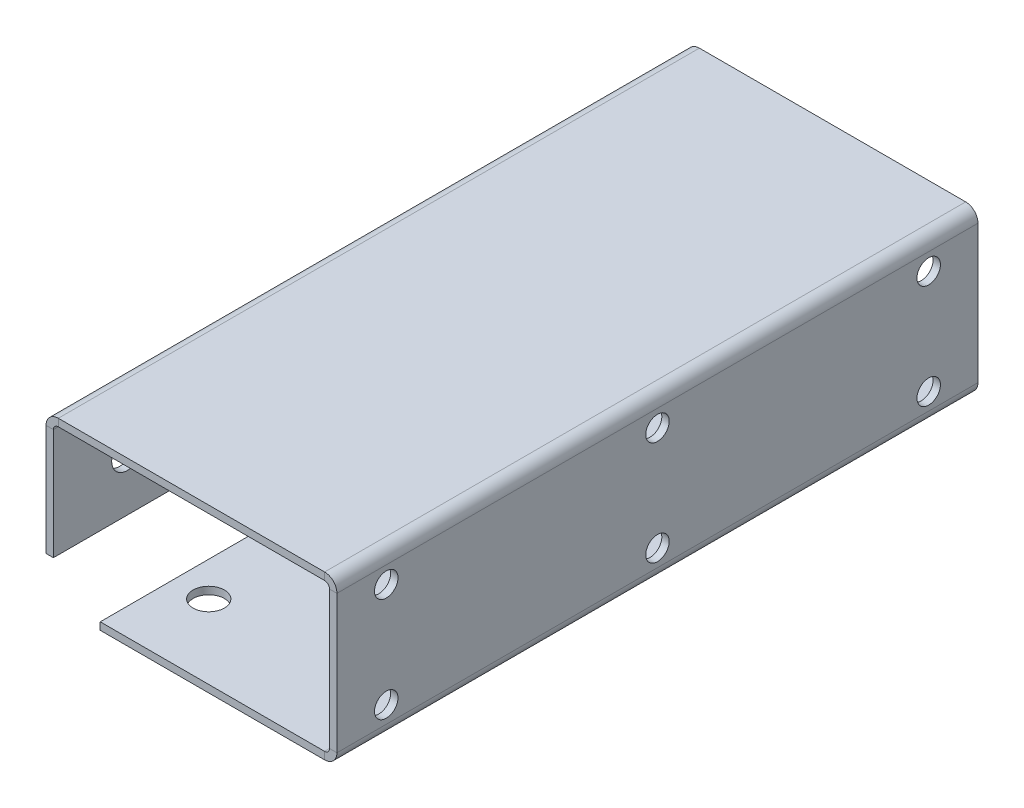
ISO-10303-21;
HEADER;
FILE_DESCRIPTION(('STEP AP214'),'2;1');
FILE_NAME('part.step','',(''),(''),'','','');
FILE_SCHEMA(('AUTOMOTIVE_DESIGN { 1 0 10303 214 1 1 1 1 }'));
ENDSEC;
DATA;
#1=APPLICATION_CONTEXT('core data for automotive mechanical design processes');
#2=APPLICATION_PROTOCOL_DEFINITION('international standard','automotive_design',2000,#1);
#3=PRODUCT_CONTEXT('',#1,'mechanical');
#4=PRODUCT('Part','Part','',(#3));
#5=PRODUCT_RELATED_PRODUCT_CATEGORY('part','',(#4));
#6=PRODUCT_DEFINITION_FORMATION('','',#4);
#7=PRODUCT_DEFINITION_CONTEXT('part definition',#1,'design');
#8=PRODUCT_DEFINITION('design','',#6,#7);
#9=PRODUCT_DEFINITION_SHAPE('','',#8);
#10=(LENGTH_UNIT() NAMED_UNIT(*) SI_UNIT(.MILLI.,.METRE.));
#11=(NAMED_UNIT(*) PLANE_ANGLE_UNIT() SI_UNIT($,.RADIAN.));
#12=(NAMED_UNIT(*) SI_UNIT($,.STERADIAN.) SOLID_ANGLE_UNIT());
#13=UNCERTAINTY_MEASURE_WITH_UNIT(LENGTH_MEASURE(1.E-05),#10,'distance_accuracy_value','');
#14=(GEOMETRIC_REPRESENTATION_CONTEXT(3) GLOBAL_UNCERTAINTY_ASSIGNED_CONTEXT((#13)) GLOBAL_UNIT_ASSIGNED_CONTEXT((#10,
#11,#12)) REPRESENTATION_CONTEXT('',''));
#15=CARTESIAN_POINT('',(0.,0.,0.));
#16=DIRECTION('',(0.,0.,1.));
#17=DIRECTION('',(1.,0.,0.));
#18=AXIS2_PLACEMENT_3D('',#15,#16,#17);
#19=CARTESIAN_POINT('',(2.5,0.,65.));
#20=DIRECTION('',(0.,0.,1.));
#21=DIRECTION('',(1.,0.,0.));
#22=AXIS2_PLACEMENT_3D('',#19,#20,#21);
#23=PLANE('',#22);
#24=DIRECTION('',(0.,-1.,0.));
#25=VECTOR('',#24,1.);
#26=CARTESIAN_POINT('',(2.5,0.,65.));
#27=LINE('',#26,#25);
#28=CARTESIAN_POINT('',(2.5,0.,65.));
#29=VERTEX_POINT('',#28);
#30=CARTESIAN_POINT('',(2.5,-1.5,65.));
#31=VERTEX_POINT('',#30);
#32=EDGE_CURVE('E13',#29,#31,#27,.T.);
#33=ORIENTED_EDGE('',*,*,#32,.F.);
#34=CARTESIAN_POINT('',(2.5,-2.5,65.));
#35=DIRECTION('',(0.,0.,1.));
#36=DIRECTION('',(1.,0.,0.));
#37=AXIS2_PLACEMENT_3D('',#34,#35,#36);
#38=CIRCLE('',#37,2.5);
#39=CARTESIAN_POINT('',(0.,-2.5,65.));
#40=VERTEX_POINT('',#39);
#41=EDGE_CURVE('E388',#40,#29,#38,.F.);
#42=ORIENTED_EDGE('',*,*,#41,.F.);
#43=DIRECTION('',(-1.,0.,0.));
#44=VECTOR('',#43,1.);
#45=CARTESIAN_POINT('',(1.5,-2.5,65.));
#46=LINE('',#45,#44);
#47=CARTESIAN_POINT('',(1.5,-2.5,65.));
#48=VERTEX_POINT('',#47);
#49=EDGE_CURVE('E56',#48,#40,#46,.T.);
#50=ORIENTED_EDGE('',*,*,#49,.F.);
#51=CARTESIAN_POINT('',(2.5,-2.5,65.));
#52=DIRECTION('',(0.,0.,1.));
#53=DIRECTION('',(1.,0.,0.));
#54=AXIS2_PLACEMENT_3D('',#51,#52,#53);
#55=CIRCLE('',#54,1.);
#56=EDGE_CURVE('E400',#48,#31,#55,.F.);
#57=ORIENTED_EDGE('',*,*,#56,.T.);
#58=EDGE_LOOP('',(#33,#42,#50,#57));
#59=FACE_BOUND('',#58,.T.);
#60=ADVANCED_FACE('F47',(#59),#23,.T.);
#61=CARTESIAN_POINT('',(1.5,-2.5,65.));
#62=DIRECTION('',(0.,0.,1.));
#63=DIRECTION('',(1.,0.,0.));
#64=AXIS2_PLACEMENT_3D('',#61,#62,#63);
#65=PLANE('',#64);
#66=DIRECTION('',(1.,0.,0.));
#67=VECTOR('',#66,1.);
#68=CARTESIAN_POINT('',(0.,0.,65.));
#69=LINE('',#68,#67);
#70=CARTESIAN_POINT('',(56.5,0.,65.));
#71=VERTEX_POINT('',#70);
#72=EDGE_CURVE('E385',#29,#71,#69,.T.);
#73=ORIENTED_EDGE('',*,*,#72,.F.);
#74=ORIENTED_EDGE('',*,*,#32,.T.);
#75=DIRECTION('',(1.,0.,0.));
#76=VECTOR('',#75,1.);
#77=CARTESIAN_POINT('',(0.,-1.5,65.));
#78=LINE('',#77,#76);
#79=CARTESIAN_POINT('',(56.5,-1.5,65.));
#80=VERTEX_POINT('',#79);
#81=EDGE_CURVE('E192',#31,#80,#78,.T.);
#82=ORIENTED_EDGE('',*,*,#81,.T.);
#83=DIRECTION('',(0.,1.,0.));
#84=VECTOR('',#83,1.);
#85=CARTESIAN_POINT('',(56.5,-1.5,65.));
#86=LINE('',#85,#84);
#87=EDGE_CURVE('E183',#80,#71,#86,.T.);
#88=ORIENTED_EDGE('',*,*,#87,.T.);
#89=EDGE_LOOP('',(#73,#74,#82,#88));
#90=FACE_BOUND('',#89,.T.);
#91=ADVANCED_FACE('F406',(#90),#65,.T.);
#92=CARTESIAN_POINT('',(0.,-2.5,-65.));
#93=DIRECTION('',(0.,0.,-1.));
#94=DIRECTION('',(-1.,0.,0.));
#95=AXIS2_PLACEMENT_3D('',#92,#93,#94);
#96=PLANE('',#95);
#97=DIRECTION('',(1.,0.,0.));
#98=VECTOR('',#97,1.);
#99=CARTESIAN_POINT('',(0.,-2.5,-65.));
#100=LINE('',#99,#98);
#101=CARTESIAN_POINT('',(0.,-2.5,-65.));
#102=VERTEX_POINT('',#101);
#103=CARTESIAN_POINT('',(1.5,-2.5,-65.));
#104=VERTEX_POINT('',#103);
#105=EDGE_CURVE('E303',#102,#104,#100,.T.);
#106=ORIENTED_EDGE('',*,*,#105,.F.);
#107=CARTESIAN_POINT('',(2.5,-2.5,-65.));
#108=DIRECTION('',(0.,0.,1.));
#109=DIRECTION('',(1.,0.,0.));
#110=AXIS2_PLACEMENT_3D('',#107,#108,#109);
#111=CIRCLE('',#110,2.5);
#112=CARTESIAN_POINT('',(2.5,0.,-65.));
#113=VERTEX_POINT('',#112);
#114=EDGE_CURVE('E233',#102,#113,#111,.F.);
#115=ORIENTED_EDGE('',*,*,#114,.T.);
#116=DIRECTION('',(0.,1.,0.));
#117=VECTOR('',#116,1.);
#118=CARTESIAN_POINT('',(2.5,-1.5,-65.));
#119=LINE('',#118,#117);
#120=CARTESIAN_POINT('',(2.5,-1.5,-65.));
#121=VERTEX_POINT('',#120);
#122=EDGE_CURVE('E182',#121,#113,#119,.T.);
#123=ORIENTED_EDGE('',*,*,#122,.F.);
#124=CARTESIAN_POINT('',(2.5,-2.5,-65.));
#125=DIRECTION('',(0.,0.,1.));
#126=DIRECTION('',(1.,0.,0.));
#127=AXIS2_PLACEMENT_3D('',#124,#125,#126);
#128=CIRCLE('',#127,1.);
#129=EDGE_CURVE('E245',#104,#121,#128,.F.);
#130=ORIENTED_EDGE('',*,*,#129,.F.);
#131=EDGE_LOOP('',(#106,#115,#123,#130));
#132=FACE_BOUND('',#131,.T.);
#133=ADVANCED_FACE('F458',(#132),#96,.T.);
#134=CARTESIAN_POINT('',(2.5,-1.5,-65.));
#135=DIRECTION('',(0.,0.,-1.));
#136=DIRECTION('',(-1.,0.,0.));
#137=AXIS2_PLACEMENT_3D('',#134,#135,#136);
#138=PLANE('',#137);
#139=DIRECTION('',(0.,1.,0.));
#140=VECTOR('',#139,1.);
#141=CARTESIAN_POINT('',(0.,0.,-65.));
#142=LINE('',#141,#140);
#143=CARTESIAN_POINT('',(0.,-25.,-65.));
#144=VERTEX_POINT('',#143);
#145=EDGE_CURVE('E236',#144,#102,#142,.T.);
#146=ORIENTED_EDGE('',*,*,#145,.T.);
#147=ORIENTED_EDGE('',*,*,#105,.T.);
#148=DIRECTION('',(0.,1.,0.));
#149=VECTOR('',#148,1.);
#150=CARTESIAN_POINT('',(1.5,0.,-65.));
#151=LINE('',#150,#149);
#152=CARTESIAN_POINT('',(1.5,-25.,-65.));
#153=VERTEX_POINT('',#152);
#154=EDGE_CURVE('E242',#153,#104,#151,.T.);
#155=ORIENTED_EDGE('',*,*,#154,.F.);
#156=DIRECTION('',(-1.,0.,0.));
#157=VECTOR('',#156,1.);
#158=CARTESIAN_POINT('',(1.5,-25.,-65.));
#159=LINE('',#158,#157);
#160=EDGE_CURVE('E239',#153,#144,#159,.T.);
#161=ORIENTED_EDGE('',*,*,#160,.T.);
#162=EDGE_LOOP('',(#146,#147,#155,#161));
#163=FACE_BOUND('',#162,.T.);
#164=ADVANCED_FACE('F492',(#163),#138,.T.);
#165=CARTESIAN_POINT('',(59.,-2.5,65.));
#166=DIRECTION('',(0.,0.,1.));
#167=DIRECTION('',(1.,0.,0.));
#168=AXIS2_PLACEMENT_3D('',#165,#166,#167);
#169=PLANE('',#168);
#170=DIRECTION('',(-1.,0.,0.));
#171=VECTOR('',#170,1.);
#172=CARTESIAN_POINT('',(59.,-2.5,65.));
#173=LINE('',#172,#171);
#174=CARTESIAN_POINT('',(59.,-2.5,65.));
#175=VERTEX_POINT('',#174);
#176=CARTESIAN_POINT('',(57.5,-2.5,65.));
#177=VERTEX_POINT('',#176);
#178=EDGE_CURVE('E170',#175,#177,#173,.T.);
#179=ORIENTED_EDGE('',*,*,#178,.F.);
#180=CARTESIAN_POINT('',(56.5,-2.5,65.));
#181=DIRECTION('',(0.,0.,1.));
#182=DIRECTION('',(1.,0.,0.));
#183=AXIS2_PLACEMENT_3D('',#180,#181,#182);
#184=CIRCLE('',#183,2.5);
#185=EDGE_CURVE('E383',#71,#175,#184,.F.);
#186=ORIENTED_EDGE('',*,*,#185,.F.);
#187=ORIENTED_EDGE('',*,*,#87,.F.);
#188=CARTESIAN_POINT('',(56.5,-2.5,65.));
#189=DIRECTION('',(0.,0.,1.));
#190=DIRECTION('',(1.,0.,0.));
#191=AXIS2_PLACEMENT_3D('',#188,#189,#190);
#192=CIRCLE('',#191,1.);
#193=EDGE_CURVE('E186',#80,#177,#192,.F.);
#194=ORIENTED_EDGE('',*,*,#193,.T.);
#195=EDGE_LOOP('',(#179,#186,#187,#194));
#196=FACE_BOUND('',#195,.T.);
#197=ADVANCED_FACE('F188',(#196),#169,.T.);
#198=CARTESIAN_POINT('',(56.5,-1.5,65.));
#199=DIRECTION('',(0.,0.,1.));
#200=DIRECTION('',(1.,0.,0.));
#201=AXIS2_PLACEMENT_3D('',#198,#199,#200);
#202=PLANE('',#201);
#203=DIRECTION('',(0.,-1.,0.));
#204=VECTOR('',#203,1.);
#205=CARTESIAN_POINT('',(59.,0.,65.));
#206=LINE('',#205,#204);
#207=CARTESIAN_POINT('',(59.,-30.5,65.));
#208=VERTEX_POINT('',#207);
#209=EDGE_CURVE('E177',#175,#208,#206,.T.);
#210=ORIENTED_EDGE('',*,*,#209,.F.);
#211=ORIENTED_EDGE('',*,*,#178,.T.);
#212=DIRECTION('',(0.,-1.,0.));
#213=VECTOR('',#212,1.);
#214=CARTESIAN_POINT('',(57.5,0.,65.));
#215=LINE('',#214,#213);
#216=CARTESIAN_POINT('',(57.5,-30.5,65.));
#217=VERTEX_POINT('',#216);
#218=EDGE_CURVE('E174',#177,#217,#215,.T.);
#219=ORIENTED_EDGE('',*,*,#218,.T.);
#220=DIRECTION('',(1.,0.,0.));
#221=VECTOR('',#220,1.);
#222=CARTESIAN_POINT('',(57.5,-30.5,65.));
#223=LINE('',#222,#221);
#224=EDGE_CURVE('E294',#217,#208,#223,.T.);
#225=ORIENTED_EDGE('',*,*,#224,.T.);
#226=EDGE_LOOP('',(#210,#211,#219,#225));
#227=FACE_BOUND('',#226,.T.);
#228=ADVANCED_FACE('F172',(#227),#202,.T.);
#229=CARTESIAN_POINT('',(56.5,0.,-65.));
#230=DIRECTION('',(0.,0.,-1.));
#231=DIRECTION('',(-1.,0.,0.));
#232=AXIS2_PLACEMENT_3D('',#229,#230,#231);
#233=PLANE('',#232);
#234=DIRECTION('',(0.,-1.,0.));
#235=VECTOR('',#234,1.);
#236=CARTESIAN_POINT('',(56.5,0.,-65.));
#237=LINE('',#236,#235);
#238=CARTESIAN_POINT('',(56.5,0.,-65.));
#239=VERTEX_POINT('',#238);
#240=CARTESIAN_POINT('',(56.5,-1.5,-65.));
#241=VERTEX_POINT('',#240);
#242=EDGE_CURVE('E299',#239,#241,#237,.T.);
#243=ORIENTED_EDGE('',*,*,#242,.F.);
#244=CARTESIAN_POINT('',(56.5,-2.5,-65.));
#245=DIRECTION('',(0.,0.,1.));
#246=DIRECTION('',(1.,0.,0.));
#247=AXIS2_PLACEMENT_3D('',#244,#245,#246);
#248=CIRCLE('',#247,2.5);
#249=CARTESIAN_POINT('',(59.,-2.5,-65.));
#250=VERTEX_POINT('',#249);
#251=EDGE_CURVE('E227',#239,#250,#248,.F.);
#252=ORIENTED_EDGE('',*,*,#251,.T.);
#253=DIRECTION('',(1.,0.,0.));
#254=VECTOR('',#253,1.);
#255=CARTESIAN_POINT('',(57.5,-2.5,-65.));
#256=LINE('',#255,#254);
#257=CARTESIAN_POINT('',(57.5,-2.5,-65.));
#258=VERTEX_POINT('',#257);
#259=EDGE_CURVE('E297',#258,#250,#256,.T.);
#260=ORIENTED_EDGE('',*,*,#259,.F.);
#261=CARTESIAN_POINT('',(56.5,-2.5,-65.));
#262=DIRECTION('',(0.,0.,1.));
#263=DIRECTION('',(1.,0.,0.));
#264=AXIS2_PLACEMENT_3D('',#261,#262,#263);
#265=CIRCLE('',#264,1.);
#266=EDGE_CURVE('E199',#241,#258,#265,.F.);
#267=ORIENTED_EDGE('',*,*,#266,.F.);
#268=EDGE_LOOP('',(#243,#252,#260,#267));
#269=FACE_BOUND('',#268,.T.);
#270=ADVANCED_FACE('F412',(#269),#233,.T.);
#271=CARTESIAN_POINT('',(57.5,-2.5,-65.));
#272=DIRECTION('',(0.,0.,-1.));
#273=DIRECTION('',(-1.,0.,0.));
#274=AXIS2_PLACEMENT_3D('',#271,#272,#273);
#275=PLANE('',#274);
#276=DIRECTION('',(1.,0.,0.));
#277=VECTOR('',#276,1.);
#278=CARTESIAN_POINT('',(0.,0.,-65.));
#279=LINE('',#278,#277);
#280=EDGE_CURVE('E230',#113,#239,#279,.T.);
#281=ORIENTED_EDGE('',*,*,#280,.T.);
#282=ORIENTED_EDGE('',*,*,#242,.T.);
#283=DIRECTION('',(1.,0.,0.));
#284=VECTOR('',#283,1.);
#285=CARTESIAN_POINT('',(0.,-1.5,-65.));
#286=LINE('',#285,#284);
#287=EDGE_CURVE('E248',#121,#241,#286,.T.);
#288=ORIENTED_EDGE('',*,*,#287,.F.);
#289=ORIENTED_EDGE('',*,*,#122,.T.);
#290=EDGE_LOOP('',(#281,#282,#288,#289));
#291=FACE_BOUND('',#290,.T.);
#292=ADVANCED_FACE('F489',(#291),#275,.T.);
#293=CARTESIAN_POINT('',(56.5,-33.,65.));
#294=DIRECTION('',(0.,0.,1.));
#295=DIRECTION('',(1.,0.,0.));
#296=AXIS2_PLACEMENT_3D('',#293,#294,#295);
#297=PLANE('',#296);
#298=DIRECTION('',(0.,1.,0.));
#299=VECTOR('',#298,1.);
#300=CARTESIAN_POINT('',(56.5,-33.,65.));
#301=LINE('',#300,#299);
#302=CARTESIAN_POINT('',(56.5,-33.,65.));
#303=VERTEX_POINT('',#302);
#304=CARTESIAN_POINT('',(56.5,-31.5,65.));
#305=VERTEX_POINT('',#304);
#306=EDGE_CURVE('E65',#303,#305,#301,.T.);
#307=ORIENTED_EDGE('',*,*,#306,.F.);
#308=CARTESIAN_POINT('',(56.5,-30.5,65.));
#309=DIRECTION('',(0.,0.,1.));
#310=DIRECTION('',(1.,0.,0.));
#311=AXIS2_PLACEMENT_3D('',#308,#309,#310);
#312=CIRCLE('',#311,2.5);
#313=EDGE_CURVE('E379',#208,#303,#312,.F.);
#314=ORIENTED_EDGE('',*,*,#313,.F.);
#315=ORIENTED_EDGE('',*,*,#224,.F.);
#316=CARTESIAN_POINT('',(56.5,-30.5,65.));
#317=DIRECTION('',(0.,0.,1.));
#318=DIRECTION('',(1.,0.,0.));
#319=AXIS2_PLACEMENT_3D('',#316,#317,#318);
#320=CIRCLE('',#319,1.);
#321=EDGE_CURVE('E207',#217,#305,#320,.F.);
#322=ORIENTED_EDGE('',*,*,#321,.T.);
#323=EDGE_LOOP('',(#307,#314,#315,#322));
#324=FACE_BOUND('',#323,.T.);
#325=ADVANCED_FACE('F508',(#324),#297,.T.);
#326=CARTESIAN_POINT('',(57.5,-30.5,65.));
#327=DIRECTION('',(0.,0.,1.));
#328=DIRECTION('',(1.,0.,0.));
#329=AXIS2_PLACEMENT_3D('',#326,#327,#328);
#330=PLANE('',#329);
#331=DIRECTION('',(-1.,0.,0.));
#332=VECTOR('',#331,1.);
#333=CARTESIAN_POINT('',(59.,-33.,65.));
#334=LINE('',#333,#332);
#335=CARTESIAN_POINT('',(11.,-33.,65.));
#336=VERTEX_POINT('',#335);
#337=EDGE_CURVE('E376',#303,#336,#334,.T.);
#338=ORIENTED_EDGE('',*,*,#337,.F.);
#339=ORIENTED_EDGE('',*,*,#306,.T.);
#340=DIRECTION('',(-1.,0.,0.));
#341=VECTOR('',#340,1.);
#342=CARTESIAN_POINT('',(59.,-31.5,65.));
#343=LINE('',#342,#341);
#344=CARTESIAN_POINT('',(11.,-31.5,65.));
#345=VERTEX_POINT('',#344);
#346=EDGE_CURVE('E131',#305,#345,#343,.T.);
#347=ORIENTED_EDGE('',*,*,#346,.T.);
#348=DIRECTION('',(0.,1.,0.));
#349=VECTOR('',#348,1.);
#350=CARTESIAN_POINT('',(11.,-33.,65.));
#351=LINE('',#350,#349);
#352=EDGE_CURVE('E373',#336,#345,#351,.T.);
#353=ORIENTED_EDGE('',*,*,#352,.F.);
#354=EDGE_LOOP('',(#338,#339,#347,#353));
#355=FACE_BOUND('',#354,.T.);
#356=ADVANCED_FACE('F439',(#355),#330,.T.);
#357=CARTESIAN_POINT('',(59.,-30.5,-65.));
#358=DIRECTION('',(0.,0.,-1.));
#359=DIRECTION('',(-1.,0.,0.));
#360=AXIS2_PLACEMENT_3D('',#357,#358,#359);
#361=PLANE('',#360);
#362=DIRECTION('',(-1.,0.,0.));
#363=VECTOR('',#362,1.);
#364=CARTESIAN_POINT('',(59.,-30.5,-65.));
#365=LINE('',#364,#363);
#366=CARTESIAN_POINT('',(59.,-30.5,-65.));
#367=VERTEX_POINT('',#366);
#368=CARTESIAN_POINT('',(57.5,-30.5,-65.));
#369=VERTEX_POINT('',#368);
#370=EDGE_CURVE('E118',#367,#369,#365,.T.);
#371=ORIENTED_EDGE('',*,*,#370,.F.);
#372=CARTESIAN_POINT('',(56.5,-30.5,-65.));
#373=DIRECTION('',(0.,0.,1.));
#374=DIRECTION('',(1.,0.,0.));
#375=AXIS2_PLACEMENT_3D('',#372,#373,#374);
#376=CIRCLE('',#375,2.5);
#377=CARTESIAN_POINT('',(56.5,-33.,-65.));
#378=VERTEX_POINT('',#377);
#379=EDGE_CURVE('E223',#367,#378,#376,.F.);
#380=ORIENTED_EDGE('',*,*,#379,.T.);
#381=DIRECTION('',(0.,-1.,0.));
#382=VECTOR('',#381,1.);
#383=CARTESIAN_POINT('',(56.5,-31.5,-65.));
#384=LINE('',#383,#382);
#385=CARTESIAN_POINT('',(56.5,-31.5,-65.));
#386=VERTEX_POINT('',#385);
#387=EDGE_CURVE('E125',#386,#378,#384,.T.);
#388=ORIENTED_EDGE('',*,*,#387,.F.);
#389=CARTESIAN_POINT('',(56.5,-30.5,-65.));
#390=DIRECTION('',(0.,0.,1.));
#391=DIRECTION('',(1.,0.,0.));
#392=AXIS2_PLACEMENT_3D('',#389,#390,#391);
#393=CIRCLE('',#392,1.);
#394=EDGE_CURVE('E254',#369,#386,#393,.F.);
#395=ORIENTED_EDGE('',*,*,#394,.F.);
#396=EDGE_LOOP('',(#371,#380,#388,#395));
#397=FACE_BOUND('',#396,.T.);
#398=ADVANCED_FACE('F427',(#397),#361,.T.);
#399=CARTESIAN_POINT('',(56.5,-31.5,-65.));
#400=DIRECTION('',(0.,0.,-1.));
#401=DIRECTION('',(-1.,0.,0.));
#402=AXIS2_PLACEMENT_3D('',#399,#400,#401);
#403=PLANE('',#402);
#404=DIRECTION('',(0.,-1.,0.));
#405=VECTOR('',#404,1.);
#406=CARTESIAN_POINT('',(59.,0.,-65.));
#407=LINE('',#406,#405);
#408=EDGE_CURVE('E225',#250,#367,#407,.T.);
#409=ORIENTED_EDGE('',*,*,#408,.T.);
#410=ORIENTED_EDGE('',*,*,#370,.T.);
#411=DIRECTION('',(0.,-1.,0.));
#412=VECTOR('',#411,1.);
#413=CARTESIAN_POINT('',(57.5,0.,-65.));
#414=LINE('',#413,#412);
#415=EDGE_CURVE('E252',#258,#369,#414,.T.);
#416=ORIENTED_EDGE('',*,*,#415,.F.);
#417=ORIENTED_EDGE('',*,*,#259,.T.);
#418=EDGE_LOOP('',(#409,#410,#416,#417));
#419=FACE_BOUND('',#418,.T.);
#420=ADVANCED_FACE('F414',(#419),#403,.T.);
#421=CARTESIAN_POINT('',(59.,-31.5,65.));
#422=DIRECTION('',(0.,-1.,0.));
#423=DIRECTION('',(1.,0.,0.));
#424=AXIS2_PLACEMENT_3D('',#421,#422,#423);
#425=PLANE('',#424);
#426=CARTESIAN_POINT('',(18.,-31.5,50.));
#427=DIRECTION('',(0.,1.,0.));
#428=DIRECTION('',(0.,0.,1.));
#429=AXIS2_PLACEMENT_3D('',#426,#427,#428);
#430=CIRCLE('',#429,3.175);
#431=CARTESIAN_POINT('',(18.,-31.5,53.175));
#432=VERTEX_POINT('',#431);
#433=EDGE_CURVE('E355',#432,#432,#430,.T.);
#434=ORIENTED_EDGE('',*,*,#433,.F.);
#435=EDGE_LOOP('',(#434));
#436=FACE_BOUND('',#435,.T.);
#437=CARTESIAN_POINT('',(18.,-31.5,-50.));
#438=DIRECTION('',(0.,1.,0.));
#439=DIRECTION('',(0.,0.,1.));
#440=AXIS2_PLACEMENT_3D('',#437,#438,#439);
#441=CIRCLE('',#440,3.175);
#442=CARTESIAN_POINT('',(18.,-31.5,-46.825));
#443=VERTEX_POINT('',#442);
#444=EDGE_CURVE('E361',#443,#443,#441,.T.);
#445=ORIENTED_EDGE('',*,*,#444,.F.);
#446=EDGE_LOOP('',(#445));
#447=FACE_BOUND('',#446,.T.);
#448=CARTESIAN_POINT('',(18.,-31.5,0.));
#449=DIRECTION('',(0.,1.,0.));
#450=DIRECTION('',(0.,0.,1.));
#451=AXIS2_PLACEMENT_3D('',#448,#449,#450);
#452=CIRCLE('',#451,3.175);
#453=CARTESIAN_POINT('',(18.,-31.5,3.175));
#454=VERTEX_POINT('',#453);
#455=EDGE_CURVE('E367',#454,#454,#452,.T.);
#456=ORIENTED_EDGE('',*,*,#455,.F.);
#457=EDGE_LOOP('',(#456));
#458=FACE_BOUND('',#457,.T.);
#459=DIRECTION('',(-1.,0.,0.));
#460=VECTOR('',#459,1.);
#461=CARTESIAN_POINT('',(59.,-31.5,-65.));
#462=LINE('',#461,#460);
#463=CARTESIAN_POINT('',(11.,-31.5,-65.));
#464=VERTEX_POINT('',#463);
#465=EDGE_CURVE('E213',#386,#464,#462,.T.);
#466=ORIENTED_EDGE('',*,*,#465,.T.);
#467=DIRECTION('',(0.,0.,-1.));
#468=VECTOR('',#467,1.);
#469=CARTESIAN_POINT('',(11.,-31.5,65.));
#470=LINE('',#469,#468);
#471=EDGE_CURVE('E290',#345,#464,#470,.T.);
#472=ORIENTED_EDGE('',*,*,#471,.F.);
#473=ORIENTED_EDGE('',*,*,#346,.F.);
#474=DIRECTION('',(0.,0.,-1.));
#475=VECTOR('',#474,1.);
#476=CARTESIAN_POINT('',(56.5,-31.5,65.));
#477=LINE('',#476,#475);
#478=EDGE_CURVE('E209',#305,#386,#477,.T.);
#479=ORIENTED_EDGE('',*,*,#478,.T.);
#480=EDGE_LOOP('',(#466,#472,#473,#479));
#481=FACE_BOUND('',#480,.T.);
#482=ADVANCED_FACE('F433',(#436,#447,#458,#481),#425,.F.);
#483=CARTESIAN_POINT('',(11.,-33.,65.));
#484=DIRECTION('',(-1.,0.,0.));
#485=DIRECTION('',(0.,0.,1.));
#486=AXIS2_PLACEMENT_3D('',#483,#484,#485);
#487=PLANE('',#486);
#488=DIRECTION('',(0.,1.,0.));
#489=VECTOR('',#488,1.);
#490=CARTESIAN_POINT('',(11.,-33.,-65.));
#491=LINE('',#490,#489);
#492=CARTESIAN_POINT('',(11.,-33.,-65.));
#493=VERTEX_POINT('',#492);
#494=EDGE_CURVE('E216',#493,#464,#491,.T.);
#495=ORIENTED_EDGE('',*,*,#494,.F.);
#496=DIRECTION('',(0.,0.,-1.));
#497=VECTOR('',#496,1.);
#498=CARTESIAN_POINT('',(11.,-33.,65.));
#499=LINE('',#498,#497);
#500=EDGE_CURVE('E288',#336,#493,#499,.T.);
#501=ORIENTED_EDGE('',*,*,#500,.F.);
#502=ORIENTED_EDGE('',*,*,#352,.T.);
#503=ORIENTED_EDGE('',*,*,#471,.T.);
#504=EDGE_LOOP('',(#495,#501,#502,#503));
#505=FACE_BOUND('',#504,.T.);
#506=ADVANCED_FACE('F438',(#505),#487,.T.);
#507=CARTESIAN_POINT('',(59.,-33.,65.));
#508=DIRECTION('',(0.,-1.,0.));
#509=DIRECTION('',(1.,0.,0.));
#510=AXIS2_PLACEMENT_3D('',#507,#508,#509);
#511=PLANE('',#510);
#512=CARTESIAN_POINT('',(18.,-33.,50.));
#513=DIRECTION('',(0.,-1.,0.));
#514=DIRECTION('',(1.,0.,0.));
#515=AXIS2_PLACEMENT_3D('',#512,#513,#514);
#516=CIRCLE('',#515,3.175);
#517=CARTESIAN_POINT('',(21.175,-33.,50.));
#518=VERTEX_POINT('',#517);
#519=EDGE_CURVE('E358',#518,#518,#516,.T.);
#520=ORIENTED_EDGE('',*,*,#519,.F.);
#521=EDGE_LOOP('',(#520));
#522=FACE_BOUND('',#521,.T.);
#523=CARTESIAN_POINT('',(18.,-33.,-50.));
#524=DIRECTION('',(0.,-1.,0.));
#525=DIRECTION('',(1.,0.,0.));
#526=AXIS2_PLACEMENT_3D('',#523,#524,#525);
#527=CIRCLE('',#526,3.175);
#528=CARTESIAN_POINT('',(21.175,-33.,-50.));
#529=VERTEX_POINT('',#528);
#530=EDGE_CURVE('E364',#529,#529,#527,.T.);
#531=ORIENTED_EDGE('',*,*,#530,.F.);
#532=EDGE_LOOP('',(#531));
#533=FACE_BOUND('',#532,.T.);
#534=CARTESIAN_POINT('',(18.,-33.,0.));
#535=DIRECTION('',(0.,-1.,0.));
#536=DIRECTION('',(1.,0.,0.));
#537=AXIS2_PLACEMENT_3D('',#534,#535,#536);
#538=CIRCLE('',#537,3.175);
#539=CARTESIAN_POINT('',(21.175,-33.,0.));
#540=VERTEX_POINT('',#539);
#541=EDGE_CURVE('E217',#540,#540,#538,.T.);
#542=ORIENTED_EDGE('',*,*,#541,.F.);
#543=EDGE_LOOP('',(#542));
#544=FACE_BOUND('',#543,.T.);
#545=DIRECTION('',(-1.,0.,0.));
#546=VECTOR('',#545,1.);
#547=CARTESIAN_POINT('',(59.,-33.,-65.));
#548=LINE('',#547,#546);
#549=EDGE_CURVE('E220',#378,#493,#548,.T.);
#550=ORIENTED_EDGE('',*,*,#549,.F.);
#551=DIRECTION('',(0.,0.,-1.));
#552=VECTOR('',#551,1.);
#553=CARTESIAN_POINT('',(56.5,-33.,65.));
#554=LINE('',#553,#552);
#555=EDGE_CURVE('E285',#303,#378,#554,.T.);
#556=ORIENTED_EDGE('',*,*,#555,.F.);
#557=ORIENTED_EDGE('',*,*,#337,.T.);
#558=ORIENTED_EDGE('',*,*,#500,.T.);
#559=EDGE_LOOP('',(#550,#556,#557,#558));
#560=FACE_BOUND('',#559,.T.);
#561=ADVANCED_FACE('F441',(#522,#533,#544,#560),#511,.T.);
#562=CARTESIAN_POINT('',(56.5,-30.5,65.));
#563=DIRECTION('',(0.,0.,-1.));
#564=DIRECTION('',(-1.,0.,0.));
#565=AXIS2_PLACEMENT_3D('',#562,#563,#564);
#566=CYLINDRICAL_SURFACE('',#565,2.5);
#567=ORIENTED_EDGE('',*,*,#379,.F.);
#568=DIRECTION('',(0.,0.,-1.));
#569=VECTOR('',#568,1.);
#570=CARTESIAN_POINT('',(59.,-30.5,65.));
#571=LINE('',#570,#569);
#572=EDGE_CURVE('E282',#208,#367,#571,.T.);
#573=ORIENTED_EDGE('',*,*,#572,.F.);
#574=ORIENTED_EDGE('',*,*,#313,.T.);
#575=ORIENTED_EDGE('',*,*,#555,.T.);
#576=EDGE_LOOP('',(#567,#573,#574,#575));
#577=FACE_BOUND('',#576,.T.);
#578=ADVANCED_FACE('F424',(#577),#566,.T.);
#579=CARTESIAN_POINT('',(59.,0.,65.));
#580=DIRECTION('',(1.,0.,0.));
#581=DIRECTION('',(0.,1.,0.));
#582=AXIS2_PLACEMENT_3D('',#579,#580,#581);
#583=PLANE('',#582);
#584=CARTESIAN_POINT('',(59.,-5.94337567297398,55.));
#585=DIRECTION('',(1.,0.,0.));
#586=DIRECTION('',(0.,0.,-1.));
#587=AXIS2_PLACEMENT_3D('',#584,#585,#586);
#588=CIRCLE('',#587,2.38125);
#589=CARTESIAN_POINT('',(59.,-5.94337567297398,52.61875));
#590=VERTEX_POINT('',#589);
#591=EDGE_CURVE('E577',#590,#590,#588,.T.);
#592=ORIENTED_EDGE('',*,*,#591,.F.);
#593=EDGE_LOOP('',(#592));
#594=FACE_BOUND('',#593,.T.);
#595=CARTESIAN_POINT('',(59.,-27.0566243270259,55.));
#596=DIRECTION('',(1.,0.,0.));
#597=DIRECTION('',(0.,0.,-1.));
#598=AXIS2_PLACEMENT_3D('',#595,#596,#597);
#599=CIRCLE('',#598,2.38125);
#600=CARTESIAN_POINT('',(59.,-27.0566243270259,52.61875));
#601=VERTEX_POINT('',#600);
#602=EDGE_CURVE('E319',#601,#601,#599,.T.);
#603=ORIENTED_EDGE('',*,*,#602,.F.);
#604=EDGE_LOOP('',(#603));
#605=FACE_BOUND('',#604,.T.);
#606=CARTESIAN_POINT('',(59.,-5.94337567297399,0.));
#607=DIRECTION('',(1.,0.,0.));
#608=DIRECTION('',(0.,0.,-1.));
#609=AXIS2_PLACEMENT_3D('',#606,#607,#608);
#610=CIRCLE('',#609,2.38125);
#611=CARTESIAN_POINT('',(59.,-5.94337567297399,-2.38125000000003));
#612=VERTEX_POINT('',#611);
#613=EDGE_CURVE('E308',#612,#612,#610,.T.);
#614=ORIENTED_EDGE('',*,*,#613,.F.);
#615=EDGE_LOOP('',(#614));
#616=FACE_BOUND('',#615,.T.);
#617=CARTESIAN_POINT('',(59.,-27.0566243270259,0.));
#618=DIRECTION('',(1.,0.,0.));
#619=DIRECTION('',(0.,0.,-1.));
#620=AXIS2_PLACEMENT_3D('',#617,#618,#619);
#621=CIRCLE('',#620,2.38125);
#622=CARTESIAN_POINT('',(59.,-27.0566243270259,-2.38125000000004));
#623=VERTEX_POINT('',#622);
#624=EDGE_CURVE('E307',#623,#623,#621,.T.);
#625=ORIENTED_EDGE('',*,*,#624,.F.);
#626=EDGE_LOOP('',(#625));
#627=FACE_BOUND('',#626,.T.);
#628=CARTESIAN_POINT('',(59.,-5.94337567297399,-55.));
#629=DIRECTION('',(1.,0.,0.));
#630=DIRECTION('',(0.,0.,-1.));
#631=AXIS2_PLACEMENT_3D('',#628,#629,#630);
#632=CIRCLE('',#631,2.38125);
#633=CARTESIAN_POINT('',(59.,-5.94337567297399,-57.38125));
#634=VERTEX_POINT('',#633);
#635=EDGE_CURVE('E325',#634,#634,#632,.T.);
#636=ORIENTED_EDGE('',*,*,#635,.F.);
#637=EDGE_LOOP('',(#636));
#638=FACE_BOUND('',#637,.T.);
#639=CARTESIAN_POINT('',(59.,-27.0566243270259,-55.));
#640=DIRECTION('',(1.,0.,0.));
#641=DIRECTION('',(0.,0.,-1.));
#642=AXIS2_PLACEMENT_3D('',#639,#640,#641);
#643=CIRCLE('',#642,2.38125);
#644=CARTESIAN_POINT('',(59.,-27.0566243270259,-57.38125));
#645=VERTEX_POINT('',#644);
#646=EDGE_CURVE('E331',#645,#645,#643,.T.);
#647=ORIENTED_EDGE('',*,*,#646,.F.);
#648=EDGE_LOOP('',(#647));
#649=FACE_BOUND('',#648,.T.);
#650=ORIENTED_EDGE('',*,*,#408,.F.);
#651=DIRECTION('',(0.,0.,-1.));
#652=VECTOR('',#651,1.);
#653=CARTESIAN_POINT('',(59.,-2.5,65.));
#654=LINE('',#653,#652);
#655=EDGE_CURVE('E279',#175,#250,#654,.T.);
#656=ORIENTED_EDGE('',*,*,#655,.F.);
#657=ORIENTED_EDGE('',*,*,#209,.T.);
#658=ORIENTED_EDGE('',*,*,#572,.T.);
#659=EDGE_LOOP('',(#650,#656,#657,#658));
#660=FACE_BOUND('',#659,.T.);
#661=ADVANCED_FACE('F419',(#594,#605,#616,#627,#638,#649,#660),#583,.T.);
#662=CARTESIAN_POINT('',(56.5,-2.5,65.));
#663=DIRECTION('',(0.,0.,-1.));
#664=DIRECTION('',(-1.,0.,0.));
#665=AXIS2_PLACEMENT_3D('',#662,#663,#664);
#666=CYLINDRICAL_SURFACE('',#665,2.5);
#667=ORIENTED_EDGE('',*,*,#251,.F.);
#668=DIRECTION('',(0.,0.,-1.));
#669=VECTOR('',#668,1.);
#670=CARTESIAN_POINT('',(56.5,0.,65.));
#671=LINE('',#670,#669);
#672=EDGE_CURVE('E276',#71,#239,#671,.T.);
#673=ORIENTED_EDGE('',*,*,#672,.F.);
#674=ORIENTED_EDGE('',*,*,#185,.T.);
#675=ORIENTED_EDGE('',*,*,#655,.T.);
#676=EDGE_LOOP('',(#667,#673,#674,#675));
#677=FACE_BOUND('',#676,.T.);
#678=ADVANCED_FACE('F417',(#677),#666,.T.);
#679=CARTESIAN_POINT('',(0.,0.,65.));
#680=DIRECTION('',(0.,1.,0.));
#681=DIRECTION('',(-1.,0.,0.));
#682=AXIS2_PLACEMENT_3D('',#679,#680,#681);
#683=PLANE('',#682);
#684=ORIENTED_EDGE('',*,*,#280,.F.);
#685=DIRECTION('',(0.,0.,-1.));
#686=VECTOR('',#685,1.);
#687=CARTESIAN_POINT('',(2.5,0.,65.));
#688=LINE('',#687,#686);
#689=EDGE_CURVE('E273',#29,#113,#688,.T.);
#690=ORIENTED_EDGE('',*,*,#689,.F.);
#691=ORIENTED_EDGE('',*,*,#72,.T.);
#692=ORIENTED_EDGE('',*,*,#672,.T.);
#693=EDGE_LOOP('',(#684,#690,#691,#692));
#694=FACE_BOUND('',#693,.T.);
#695=ADVANCED_FACE('F465',(#694),#683,.T.);
#696=CARTESIAN_POINT('',(2.5,-2.5,65.));
#697=DIRECTION('',(0.,0.,-1.));
#698=DIRECTION('',(-1.,0.,0.));
#699=AXIS2_PLACEMENT_3D('',#696,#697,#698);
#700=CYLINDRICAL_SURFACE('',#699,2.5);
#701=ORIENTED_EDGE('',*,*,#114,.F.);
#702=DIRECTION('',(0.,0.,-1.));
#703=VECTOR('',#702,1.);
#704=CARTESIAN_POINT('',(0.,-2.5,65.));
#705=LINE('',#704,#703);
#706=EDGE_CURVE('E270',#40,#102,#705,.T.);
#707=ORIENTED_EDGE('',*,*,#706,.F.);
#708=ORIENTED_EDGE('',*,*,#41,.T.);
#709=ORIENTED_EDGE('',*,*,#689,.T.);
#710=EDGE_LOOP('',(#701,#707,#708,#709));
#711=FACE_BOUND('',#710,.T.);
#712=ADVANCED_FACE('F469',(#711),#700,.T.);
#713=CARTESIAN_POINT('',(0.,0.,65.));
#714=DIRECTION('',(-1.,0.,0.));
#715=DIRECTION('',(0.,-1.,0.));
#716=AXIS2_PLACEMENT_3D('',#713,#714,#715);
#717=PLANE('',#716);
#718=CARTESIAN_POINT('',(0.,-14.,-50.));
#719=DIRECTION('',(-1.,0.,0.));
#720=DIRECTION('',(0.,-1.,0.));
#721=AXIS2_PLACEMENT_3D('',#718,#719,#720);
#722=CIRCLE('',#721,3.175);
#723=CARTESIAN_POINT('',(0.,-17.175,-50.));
#724=VERTEX_POINT('',#723);
#725=EDGE_CURVE('E340',#724,#724,#722,.T.);
#726=ORIENTED_EDGE('',*,*,#725,.F.);
#727=EDGE_LOOP('',(#726));
#728=FACE_BOUND('',#727,.T.);
#729=CARTESIAN_POINT('',(0.,-14.,50.));
#730=DIRECTION('',(-1.,0.,0.));
#731=DIRECTION('',(0.,-1.,0.));
#732=AXIS2_PLACEMENT_3D('',#729,#730,#731);
#733=CIRCLE('',#732,3.175);
#734=CARTESIAN_POINT('',(0.,-17.175,50.));
#735=VERTEX_POINT('',#734);
#736=EDGE_CURVE('E346',#735,#735,#733,.T.);
#737=ORIENTED_EDGE('',*,*,#736,.F.);
#738=EDGE_LOOP('',(#737));
#739=FACE_BOUND('',#738,.T.);
#740=CARTESIAN_POINT('',(0.,-14.,0.));
#741=DIRECTION('',(-1.,0.,0.));
#742=DIRECTION('',(0.,-1.,0.));
#743=AXIS2_PLACEMENT_3D('',#740,#741,#742);
#744=CIRCLE('',#743,3.175);
#745=CARTESIAN_POINT('',(0.,-17.175,0.));
#746=VERTEX_POINT('',#745);
#747=EDGE_CURVE('E352',#746,#746,#744,.T.);
#748=ORIENTED_EDGE('',*,*,#747,.F.);
#749=EDGE_LOOP('',(#748));
#750=FACE_BOUND('',#749,.T.);
#751=ORIENTED_EDGE('',*,*,#145,.F.);
#752=DIRECTION('',(0.,0.,-1.));
#753=VECTOR('',#752,1.);
#754=CARTESIAN_POINT('',(0.,-25.,65.));
#755=LINE('',#754,#753);
#756=CARTESIAN_POINT('',(0.,-25.,65.));
#757=VERTEX_POINT('',#756);
#758=EDGE_CURVE('E268',#757,#144,#755,.T.);
#759=ORIENTED_EDGE('',*,*,#758,.F.);
#760=DIRECTION('',(0.,1.,0.));
#761=VECTOR('',#760,1.);
#762=CARTESIAN_POINT('',(0.,0.,65.));
#763=LINE('',#762,#761);
#764=EDGE_CURVE('E391',#757,#40,#763,.T.);
#765=ORIENTED_EDGE('',*,*,#764,.T.);
#766=ORIENTED_EDGE('',*,*,#706,.T.);
#767=EDGE_LOOP('',(#751,#759,#765,#766));
#768=FACE_BOUND('',#767,.T.);
#769=ADVANCED_FACE('F472',(#728,#739,#750,#768),#717,.T.);
#770=CARTESIAN_POINT('',(1.5,-25.,65.));
#771=DIRECTION('',(0.,-1.,0.));
#772=DIRECTION('',(0.,0.,-1.));
#773=AXIS2_PLACEMENT_3D('',#770,#771,#772);
#774=PLANE('',#773);
#775=ORIENTED_EDGE('',*,*,#160,.F.);
#776=DIRECTION('',(0.,0.,-1.));
#777=VECTOR('',#776,1.);
#778=CARTESIAN_POINT('',(1.5,-25.,65.));
#779=LINE('',#778,#777);
#780=CARTESIAN_POINT('',(1.5,-25.,65.));
#781=VERTEX_POINT('',#780);
#782=EDGE_CURVE('E266',#781,#153,#779,.T.);
#783=ORIENTED_EDGE('',*,*,#782,.F.);
#784=DIRECTION('',(-1.,0.,0.));
#785=VECTOR('',#784,1.);
#786=CARTESIAN_POINT('',(1.5,-25.,65.));
#787=LINE('',#786,#785);
#788=EDGE_CURVE('E394',#781,#757,#787,.T.);
#789=ORIENTED_EDGE('',*,*,#788,.T.);
#790=ORIENTED_EDGE('',*,*,#758,.T.);
#791=EDGE_LOOP('',(#775,#783,#789,#790));
#792=FACE_BOUND('',#791,.T.);
#793=ADVANCED_FACE('F479',(#792),#774,.T.);
#794=CARTESIAN_POINT('',(1.5,0.,65.));
#795=DIRECTION('',(-1.,0.,0.));
#796=DIRECTION('',(0.,-1.,0.));
#797=AXIS2_PLACEMENT_3D('',#794,#795,#796);
#798=PLANE('',#797);
#799=CARTESIAN_POINT('',(1.5,-14.,-50.));
#800=DIRECTION('',(1.,0.,0.));
#801=DIRECTION('',(0.,0.,-1.));
#802=AXIS2_PLACEMENT_3D('',#799,#800,#801);
#803=CIRCLE('',#802,3.175);
#804=CARTESIAN_POINT('',(1.5,-14.,-53.175));
#805=VERTEX_POINT('',#804);
#806=EDGE_CURVE('E337',#805,#805,#803,.T.);
#807=ORIENTED_EDGE('',*,*,#806,.F.);
#808=EDGE_LOOP('',(#807));
#809=FACE_BOUND('',#808,.T.);
#810=CARTESIAN_POINT('',(1.5,-14.,50.));
#811=DIRECTION('',(1.,0.,0.));
#812=DIRECTION('',(0.,0.,-1.));
#813=AXIS2_PLACEMENT_3D('',#810,#811,#812);
#814=CIRCLE('',#813,3.175);
#815=CARTESIAN_POINT('',(1.5,-14.,46.825));
#816=VERTEX_POINT('',#815);
#817=EDGE_CURVE('E343',#816,#816,#814,.T.);
#818=ORIENTED_EDGE('',*,*,#817,.F.);
#819=EDGE_LOOP('',(#818));
#820=FACE_BOUND('',#819,.T.);
#821=CARTESIAN_POINT('',(1.5,-14.,0.));
#822=DIRECTION('',(1.,0.,0.));
#823=DIRECTION('',(0.,0.,-1.));
#824=AXIS2_PLACEMENT_3D('',#821,#822,#823);
#825=CIRCLE('',#824,3.175);
#826=CARTESIAN_POINT('',(1.5,-14.,-3.175));
#827=VERTEX_POINT('',#826);
#828=EDGE_CURVE('E349',#827,#827,#825,.T.);
#829=ORIENTED_EDGE('',*,*,#828,.F.);
#830=EDGE_LOOP('',(#829));
#831=FACE_BOUND('',#830,.T.);
#832=ORIENTED_EDGE('',*,*,#154,.T.);
#833=DIRECTION('',(0.,0.,-1.));
#834=VECTOR('',#833,1.);
#835=CARTESIAN_POINT('',(1.5,-2.5,65.));
#836=LINE('',#835,#834);
#837=EDGE_CURVE('E263',#48,#104,#836,.T.);
#838=ORIENTED_EDGE('',*,*,#837,.F.);
#839=DIRECTION('',(0.,1.,0.));
#840=VECTOR('',#839,1.);
#841=CARTESIAN_POINT('',(1.5,0.,65.));
#842=LINE('',#841,#840);
#843=EDGE_CURVE('E397',#781,#48,#842,.T.);
#844=ORIENTED_EDGE('',*,*,#843,.F.);
#845=ORIENTED_EDGE('',*,*,#782,.T.);
#846=EDGE_LOOP('',(#832,#838,#844,#845));
#847=FACE_BOUND('',#846,.T.);
#848=ADVANCED_FACE('F484',(#809,#820,#831,#847),#798,.F.);
#849=CARTESIAN_POINT('',(2.5,-2.5,65.));
#850=DIRECTION('',(0.,0.,-1.));
#851=DIRECTION('',(-1.,0.,0.));
#852=AXIS2_PLACEMENT_3D('',#849,#850,#851);
#853=CYLINDRICAL_SURFACE('',#852,1.);
#854=ORIENTED_EDGE('',*,*,#129,.T.);
#855=DIRECTION('',(0.,0.,-1.));
#856=VECTOR('',#855,1.);
#857=CARTESIAN_POINT('',(2.5,-1.5,65.));
#858=LINE('',#857,#856);
#859=EDGE_CURVE('E260',#31,#121,#858,.T.);
#860=ORIENTED_EDGE('',*,*,#859,.F.);
#861=ORIENTED_EDGE('',*,*,#56,.F.);
#862=ORIENTED_EDGE('',*,*,#837,.T.);
#863=EDGE_LOOP('',(#854,#860,#861,#862));
#864=FACE_BOUND('',#863,.T.);
#865=ADVANCED_FACE('F487',(#864),#853,.F.);
#866=CARTESIAN_POINT('',(0.,-1.5,65.));
#867=DIRECTION('',(0.,1.,0.));
#868=DIRECTION('',(-1.,0.,0.));
#869=AXIS2_PLACEMENT_3D('',#866,#867,#868);
#870=PLANE('',#869);
#871=ORIENTED_EDGE('',*,*,#287,.T.);
#872=DIRECTION('',(0.,0.,-1.));
#873=VECTOR('',#872,1.);
#874=CARTESIAN_POINT('',(56.5,-1.5,65.));
#875=LINE('',#874,#873);
#876=EDGE_CURVE('E201',#80,#241,#875,.T.);
#877=ORIENTED_EDGE('',*,*,#876,.F.);
#878=ORIENTED_EDGE('',*,*,#81,.F.);
#879=ORIENTED_EDGE('',*,*,#859,.T.);
#880=EDGE_LOOP('',(#871,#877,#878,#879));
#881=FACE_BOUND('',#880,.T.);
#882=ADVANCED_FACE('F409',(#881),#870,.F.);
#883=CARTESIAN_POINT('',(56.5,-2.5,65.));
#884=DIRECTION('',(0.,0.,-1.));
#885=DIRECTION('',(-1.,0.,0.));
#886=AXIS2_PLACEMENT_3D('',#883,#884,#885);
#887=CYLINDRICAL_SURFACE('',#886,1.);
#888=ORIENTED_EDGE('',*,*,#266,.T.);
#889=DIRECTION('',(0.,0.,-1.));
#890=VECTOR('',#889,1.);
#891=CARTESIAN_POINT('',(57.5,-2.5,65.));
#892=LINE('',#891,#890);
#893=EDGE_CURVE('E196',#177,#258,#892,.T.);
#894=ORIENTED_EDGE('',*,*,#893,.F.);
#895=ORIENTED_EDGE('',*,*,#193,.F.);
#896=ORIENTED_EDGE('',*,*,#876,.T.);
#897=EDGE_LOOP('',(#888,#894,#895,#896));
#898=FACE_BOUND('',#897,.T.);
#899=ADVANCED_FACE('F197',(#898),#887,.F.);
#900=CARTESIAN_POINT('',(57.5,0.,65.));
#901=DIRECTION('',(1.,0.,0.));
#902=DIRECTION('',(0.,1.,0.));
#903=AXIS2_PLACEMENT_3D('',#900,#901,#902);
#904=PLANE('',#903);
#905=CARTESIAN_POINT('',(57.5,-5.94337567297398,55.));
#906=DIRECTION('',(1.,0.,0.));
#907=DIRECTION('',(0.,1.,0.));
#908=AXIS2_PLACEMENT_3D('',#905,#906,#907);
#909=CIRCLE('',#908,2.38125);
#910=CARTESIAN_POINT('',(57.5,-3.56212567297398,55.));
#911=VERTEX_POINT('',#910);
#912=EDGE_CURVE('E717',#911,#911,#909,.T.);
#913=ORIENTED_EDGE('',*,*,#912,.T.);
#914=EDGE_LOOP('',(#913));
#915=FACE_BOUND('',#914,.T.);
#916=CARTESIAN_POINT('',(57.5,-27.0566243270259,55.));
#917=DIRECTION('',(1.,0.,0.));
#918=DIRECTION('',(0.,1.,0.));
#919=AXIS2_PLACEMENT_3D('',#916,#917,#918);
#920=CIRCLE('',#919,2.38125);
#921=CARTESIAN_POINT('',(57.5,-24.6753743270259,55.));
#922=VERTEX_POINT('',#921);
#923=EDGE_CURVE('E50',#922,#922,#920,.T.);
#924=ORIENTED_EDGE('',*,*,#923,.T.);
#925=EDGE_LOOP('',(#924));
#926=FACE_BOUND('',#925,.T.);
#927=CARTESIAN_POINT('',(57.5,-5.94337567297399,0.));
#928=DIRECTION('',(1.,0.,0.));
#929=DIRECTION('',(0.,1.,0.));
#930=AXIS2_PLACEMENT_3D('',#927,#928,#929);
#931=CIRCLE('',#930,2.38125);
#932=CARTESIAN_POINT('',(57.5,-3.56212567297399,0.));
#933=VERTEX_POINT('',#932);
#934=EDGE_CURVE('E305',#933,#933,#931,.T.);
#935=ORIENTED_EDGE('',*,*,#934,.T.);
#936=EDGE_LOOP('',(#935));
#937=FACE_BOUND('',#936,.T.);
#938=CARTESIAN_POINT('',(57.5,-27.0566243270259,0.));
#939=DIRECTION('',(1.,0.,0.));
#940=DIRECTION('',(0.,1.,0.));
#941=AXIS2_PLACEMENT_3D('',#938,#939,#940);
#942=CIRCLE('',#941,2.38125);
#943=CARTESIAN_POINT('',(57.5,-24.6753743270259,0.));
#944=VERTEX_POINT('',#943);
#945=EDGE_CURVE('E312',#944,#944,#942,.T.);
#946=ORIENTED_EDGE('',*,*,#945,.T.);
#947=EDGE_LOOP('',(#946));
#948=FACE_BOUND('',#947,.T.);
#949=CARTESIAN_POINT('',(57.5,-5.94337567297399,-55.));
#950=DIRECTION('',(1.,0.,0.));
#951=DIRECTION('',(0.,1.,0.));
#952=AXIS2_PLACEMENT_3D('',#949,#950,#951);
#953=CIRCLE('',#952,2.38125);
#954=CARTESIAN_POINT('',(57.5,-3.56212567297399,-55.));
#955=VERTEX_POINT('',#954);
#956=EDGE_CURVE('E328',#955,#955,#953,.T.);
#957=ORIENTED_EDGE('',*,*,#956,.T.);
#958=EDGE_LOOP('',(#957));
#959=FACE_BOUND('',#958,.T.);
#960=CARTESIAN_POINT('',(57.5,-27.0566243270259,-55.));
#961=DIRECTION('',(1.,0.,0.));
#962=DIRECTION('',(0.,1.,0.));
#963=AXIS2_PLACEMENT_3D('',#960,#961,#962);
#964=CIRCLE('',#963,2.38125);
#965=CARTESIAN_POINT('',(57.5,-24.6753743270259,-55.));
#966=VERTEX_POINT('',#965);
#967=EDGE_CURVE('E334',#966,#966,#964,.T.);
#968=ORIENTED_EDGE('',*,*,#967,.T.);
#969=EDGE_LOOP('',(#968));
#970=FACE_BOUND('',#969,.T.);
#971=ORIENTED_EDGE('',*,*,#415,.T.);
#972=DIRECTION('',(0.,0.,-1.));
#973=VECTOR('',#972,1.);
#974=CARTESIAN_POINT('',(57.5,-30.5,65.));
#975=LINE('',#974,#973);
#976=EDGE_CURVE('E202',#217,#369,#975,.T.);
#977=ORIENTED_EDGE('',*,*,#976,.F.);
#978=ORIENTED_EDGE('',*,*,#218,.F.);
#979=ORIENTED_EDGE('',*,*,#893,.T.);
#980=EDGE_LOOP('',(#971,#977,#978,#979));
#981=FACE_BOUND('',#980,.T.);
#982=ADVANCED_FACE('F204',(#915,#926,#937,#948,#959,#970,#981),#904,.F.);
#983=CARTESIAN_POINT('',(56.5,-30.5,65.));
#984=DIRECTION('',(0.,0.,-1.));
#985=DIRECTION('',(-1.,0.,0.));
#986=AXIS2_PLACEMENT_3D('',#983,#984,#985);
#987=CYLINDRICAL_SURFACE('',#986,1.);
#988=ORIENTED_EDGE('',*,*,#394,.T.);
#989=ORIENTED_EDGE('',*,*,#478,.F.);
#990=ORIENTED_EDGE('',*,*,#321,.F.);
#991=ORIENTED_EDGE('',*,*,#976,.T.);
#992=EDGE_LOOP('',(#988,#989,#990,#991));
#993=FACE_BOUND('',#992,.T.);
#994=ADVANCED_FACE('F430',(#993),#987,.F.);
#995=CARTESIAN_POINT('',(56.5,-30.5,65.));
#996=DIRECTION('',(0.,0.,1.));
#997=DIRECTION('',(1.,0.,0.));
#998=AXIS2_PLACEMENT_3D('',#995,#996,#997);
#999=PLANE('',#998);
#1000=ORIENTED_EDGE('',*,*,#843,.T.);
#1001=ORIENTED_EDGE('',*,*,#49,.T.);
#1002=ORIENTED_EDGE('',*,*,#764,.F.);
#1003=ORIENTED_EDGE('',*,*,#788,.F.);
#1004=EDGE_LOOP('',(#1000,#1001,#1002,#1003));
#1005=FACE_BOUND('',#1004,.T.);
#1006=ADVANCED_FACE('F476',(#1005),#999,.T.);
#1007=CARTESIAN_POINT('',(56.5,-30.5,-65.));
#1008=DIRECTION('',(0.,0.,1.));
#1009=DIRECTION('',(1.,0.,0.));
#1010=AXIS2_PLACEMENT_3D('',#1007,#1008,#1009);
#1011=PLANE('',#1010);
#1012=ORIENTED_EDGE('',*,*,#465,.F.);
#1013=ORIENTED_EDGE('',*,*,#387,.T.);
#1014=ORIENTED_EDGE('',*,*,#549,.T.);
#1015=ORIENTED_EDGE('',*,*,#494,.T.);
#1016=EDGE_LOOP('',(#1012,#1013,#1014,#1015));
#1017=FACE_BOUND('',#1016,.T.);
#1018=ADVANCED_FACE('F435',(#1017),#1011,.F.);
#1019=CARTESIAN_POINT('',(18.,-31.5,0.));
#1020=DIRECTION('',(0.,1.,0.));
#1021=DIRECTION('',(0.,0.,1.));
#1022=AXIS2_PLACEMENT_3D('',#1019,#1020,#1021);
#1023=CYLINDRICAL_SURFACE('',#1022,3.175);
#1024=ORIENTED_EDGE('',*,*,#541,.T.);
#1025=EDGE_LOOP('',(#1024));
#1026=FACE_BOUND('',#1025,.T.);
#1027=ORIENTED_EDGE('',*,*,#455,.T.);
#1028=EDGE_LOOP('',(#1027));
#1029=FACE_BOUND('',#1028,.T.);
#1030=ADVANCED_FACE('F528',(#1026,#1029),#1023,.F.);
#1031=CARTESIAN_POINT('',(18.,-31.5,-50.));
#1032=DIRECTION('',(0.,1.,0.));
#1033=DIRECTION('',(0.,0.,1.));
#1034=AXIS2_PLACEMENT_3D('',#1031,#1032,#1033);
#1035=CYLINDRICAL_SURFACE('',#1034,3.175);
#1036=ORIENTED_EDGE('',*,*,#530,.T.);
#1037=EDGE_LOOP('',(#1036));
#1038=FACE_BOUND('',#1037,.T.);
#1039=ORIENTED_EDGE('',*,*,#444,.T.);
#1040=EDGE_LOOP('',(#1039));
#1041=FACE_BOUND('',#1040,.T.);
#1042=ADVANCED_FACE('F530',(#1038,#1041),#1035,.F.);
#1043=CARTESIAN_POINT('',(18.,-31.5,50.));
#1044=DIRECTION('',(0.,1.,0.));
#1045=DIRECTION('',(0.,0.,1.));
#1046=AXIS2_PLACEMENT_3D('',#1043,#1044,#1045);
#1047=CYLINDRICAL_SURFACE('',#1046,3.175);
#1048=ORIENTED_EDGE('',*,*,#519,.T.);
#1049=EDGE_LOOP('',(#1048));
#1050=FACE_BOUND('',#1049,.T.);
#1051=ORIENTED_EDGE('',*,*,#433,.T.);
#1052=EDGE_LOOP('',(#1051));
#1053=FACE_BOUND('',#1052,.T.);
#1054=ADVANCED_FACE('F537',(#1050,#1053),#1047,.F.);
#1055=CARTESIAN_POINT('',(1.5,-14.,0.));
#1056=DIRECTION('',(1.,0.,0.));
#1057=DIRECTION('',(0.,0.,-1.));
#1058=AXIS2_PLACEMENT_3D('',#1055,#1056,#1057);
#1059=CYLINDRICAL_SURFACE('',#1058,3.175);
#1060=ORIENTED_EDGE('',*,*,#747,.T.);
#1061=EDGE_LOOP('',(#1060));
#1062=FACE_BOUND('',#1061,.T.);
#1063=ORIENTED_EDGE('',*,*,#828,.T.);
#1064=EDGE_LOOP('',(#1063));
#1065=FACE_BOUND('',#1064,.T.);
#1066=ADVANCED_FACE('F610',(#1062,#1065),#1059,.F.);
#1067=CARTESIAN_POINT('',(1.5,-14.,50.));
#1068=DIRECTION('',(1.,0.,0.));
#1069=DIRECTION('',(0.,0.,-1.));
#1070=AXIS2_PLACEMENT_3D('',#1067,#1068,#1069);
#1071=CYLINDRICAL_SURFACE('',#1070,3.175);
#1072=ORIENTED_EDGE('',*,*,#736,.T.);
#1073=EDGE_LOOP('',(#1072));
#1074=FACE_BOUND('',#1073,.T.);
#1075=ORIENTED_EDGE('',*,*,#817,.T.);
#1076=EDGE_LOOP('',(#1075));
#1077=FACE_BOUND('',#1076,.T.);
#1078=ADVANCED_FACE('F603',(#1074,#1077),#1071,.F.);
#1079=CARTESIAN_POINT('',(1.5,-14.,-50.));
#1080=DIRECTION('',(1.,0.,0.));
#1081=DIRECTION('',(0.,0.,-1.));
#1082=AXIS2_PLACEMENT_3D('',#1079,#1080,#1081);
#1083=CYLINDRICAL_SURFACE('',#1082,3.175);
#1084=ORIENTED_EDGE('',*,*,#725,.T.);
#1085=EDGE_LOOP('',(#1084));
#1086=FACE_BOUND('',#1085,.T.);
#1087=ORIENTED_EDGE('',*,*,#806,.T.);
#1088=EDGE_LOOP('',(#1087));
#1089=FACE_BOUND('',#1088,.T.);
#1090=ADVANCED_FACE('F592',(#1086,#1089),#1083,.F.);
#1091=CARTESIAN_POINT('',(59.,-27.0566243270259,-55.));
#1092=DIRECTION('',(1.,0.,0.));
#1093=DIRECTION('',(0.,0.,-1.));
#1094=AXIS2_PLACEMENT_3D('',#1091,#1092,#1093);
#1095=CYLINDRICAL_SURFACE('',#1094,2.38125);
#1096=ORIENTED_EDGE('',*,*,#646,.T.);
#1097=EDGE_LOOP('',(#1096));
#1098=FACE_BOUND('',#1097,.T.);
#1099=ORIENTED_EDGE('',*,*,#967,.F.);
#1100=EDGE_LOOP('',(#1099));
#1101=FACE_BOUND('',#1100,.T.);
#1102=ADVANCED_FACE('F588',(#1098,#1101),#1095,.F.);
#1103=CARTESIAN_POINT('',(59.,-5.94337567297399,-55.));
#1104=DIRECTION('',(1.,0.,0.));
#1105=DIRECTION('',(0.,0.,-1.));
#1106=AXIS2_PLACEMENT_3D('',#1103,#1104,#1105);
#1107=CYLINDRICAL_SURFACE('',#1106,2.38125);
#1108=ORIENTED_EDGE('',*,*,#635,.T.);
#1109=EDGE_LOOP('',(#1108));
#1110=FACE_BOUND('',#1109,.T.);
#1111=ORIENTED_EDGE('',*,*,#956,.F.);
#1112=EDGE_LOOP('',(#1111));
#1113=FACE_BOUND('',#1112,.T.);
#1114=ADVANCED_FACE('F591',(#1110,#1113),#1107,.F.);
#1115=CARTESIAN_POINT('',(59.,-27.0566243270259,0.));
#1116=DIRECTION('',(1.,0.,0.));
#1117=DIRECTION('',(0.,0.,-1.));
#1118=AXIS2_PLACEMENT_3D('',#1115,#1116,#1117);
#1119=CYLINDRICAL_SURFACE('',#1118,2.38125);
#1120=ORIENTED_EDGE('',*,*,#624,.T.);
#1121=EDGE_LOOP('',(#1120));
#1122=FACE_BOUND('',#1121,.T.);
#1123=ORIENTED_EDGE('',*,*,#945,.F.);
#1124=EDGE_LOOP('',(#1123));
#1125=FACE_BOUND('',#1124,.T.);
#1126=ADVANCED_FACE('F600',(#1122,#1125),#1119,.F.);
#1127=CARTESIAN_POINT('',(59.,-5.94337567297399,0.));
#1128=DIRECTION('',(1.,0.,0.));
#1129=DIRECTION('',(0.,0.,-1.));
#1130=AXIS2_PLACEMENT_3D('',#1127,#1128,#1129);
#1131=CYLINDRICAL_SURFACE('',#1130,2.38125);
#1132=ORIENTED_EDGE('',*,*,#613,.T.);
#1133=EDGE_LOOP('',(#1132));
#1134=FACE_BOUND('',#1133,.T.);
#1135=ORIENTED_EDGE('',*,*,#934,.F.);
#1136=EDGE_LOOP('',(#1135));
#1137=FACE_BOUND('',#1136,.T.);
#1138=ADVANCED_FACE('F674',(#1134,#1137),#1131,.F.);
#1139=CARTESIAN_POINT('',(59.,-27.0566243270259,55.));
#1140=DIRECTION('',(1.,0.,0.));
#1141=DIRECTION('',(0.,0.,-1.));
#1142=AXIS2_PLACEMENT_3D('',#1139,#1140,#1141);
#1143=CYLINDRICAL_SURFACE('',#1142,2.38125);
#1144=ORIENTED_EDGE('',*,*,#602,.T.);
#1145=EDGE_LOOP('',(#1144));
#1146=FACE_BOUND('',#1145,.T.);
#1147=ORIENTED_EDGE('',*,*,#923,.F.);
#1148=EDGE_LOOP('',(#1147));
#1149=FACE_BOUND('',#1148,.T.);
#1150=ADVANCED_FACE('F684',(#1146,#1149),#1143,.F.);
#1151=CARTESIAN_POINT('',(59.,-5.94337567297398,55.));
#1152=DIRECTION('',(1.,0.,0.));
#1153=DIRECTION('',(0.,0.,-1.));
#1154=AXIS2_PLACEMENT_3D('',#1151,#1152,#1153);
#1155=CYLINDRICAL_SURFACE('',#1154,2.38125);
#1156=ORIENTED_EDGE('',*,*,#591,.T.);
#1157=EDGE_LOOP('',(#1156));
#1158=FACE_BOUND('',#1157,.T.);
#1159=ORIENTED_EDGE('',*,*,#912,.F.);
#1160=EDGE_LOOP('',(#1159));
#1161=FACE_BOUND('',#1160,.T.);
#1162=ADVANCED_FACE('F694',(#1158,#1161),#1155,.F.);
#1163=CLOSED_SHELL('',(#60,#91,#133,#164,#197,#228,#270,#292,#325,#356,#398,#420,#482,#506,#561,
#578,#661,#678,#695,#712,#769,#793,#848,#865,#882,#899,#982,#994,#1006,#1018,#1030,#1042,#1054,
#1066,#1078,#1090,#1102,#1114,#1126,#1138,#1150,#1162));
#1164=MANIFOLD_SOLID_BREP('B2',#1163);
#1165=ADVANCED_BREP_SHAPE_REPRESENTATION('',(#18,#1164),#14);
#1166=SHAPE_DEFINITION_REPRESENTATION(#9,#1165);
ENDSEC;
END-ISO-10303-21;
